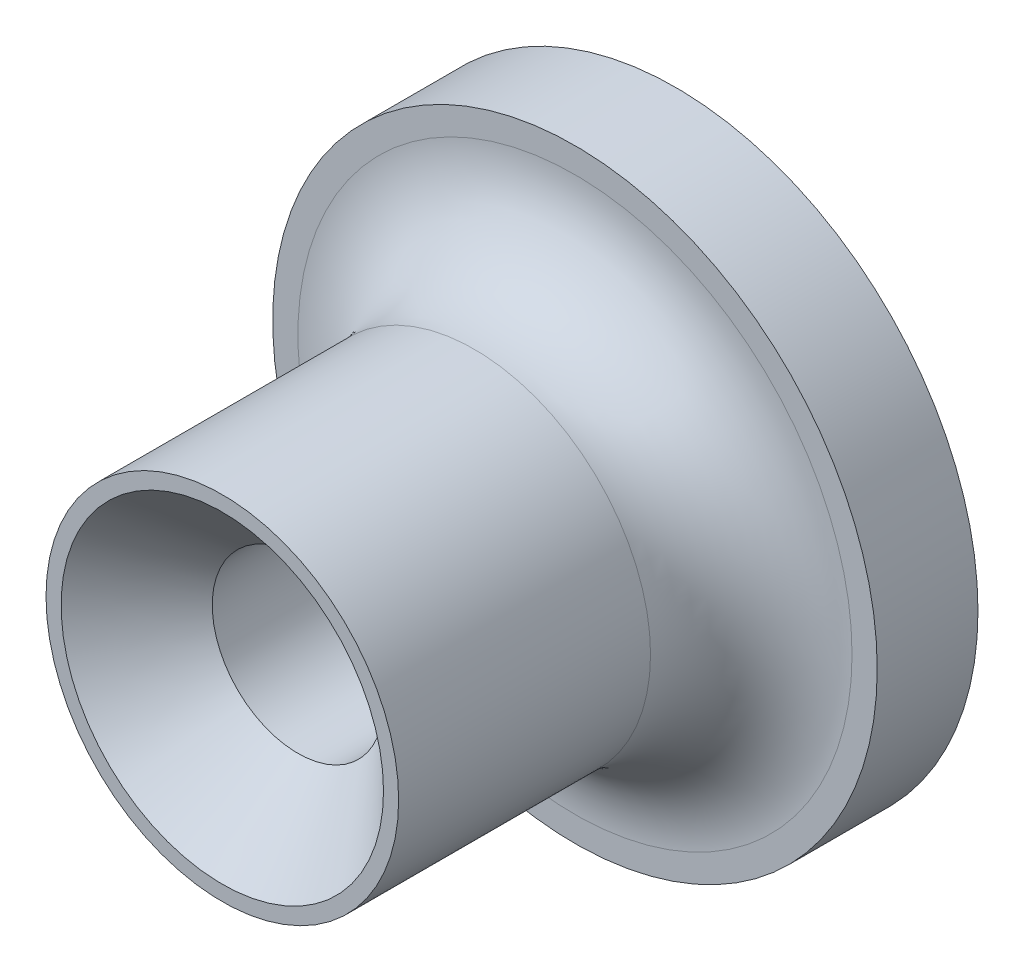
ISO-10303-21;
HEADER;
FILE_DESCRIPTION(('STEP AP214'),'2;1');
FILE_NAME('part.step','',(''),(''),'','','');
FILE_SCHEMA(('AUTOMOTIVE_DESIGN { 1 0 10303 214 1 1 1 1 }'));
ENDSEC;
DATA;
#1=APPLICATION_CONTEXT('core data for automotive mechanical design processes');
#2=APPLICATION_PROTOCOL_DEFINITION('international standard','automotive_design',2000,#1);
#3=PRODUCT_CONTEXT('',#1,'mechanical');
#4=PRODUCT('Part','Part','',(#3));
#5=PRODUCT_RELATED_PRODUCT_CATEGORY('part','',(#4));
#6=PRODUCT_DEFINITION_FORMATION('','',#4);
#7=PRODUCT_DEFINITION_CONTEXT('part definition',#1,'design');
#8=PRODUCT_DEFINITION('design','',#6,#7);
#9=PRODUCT_DEFINITION_SHAPE('','',#8);
#10=(LENGTH_UNIT() NAMED_UNIT(*) SI_UNIT(.MILLI.,.METRE.));
#11=(NAMED_UNIT(*) PLANE_ANGLE_UNIT() SI_UNIT($,.RADIAN.));
#12=(NAMED_UNIT(*) SI_UNIT($,.STERADIAN.) SOLID_ANGLE_UNIT());
#13=UNCERTAINTY_MEASURE_WITH_UNIT(LENGTH_MEASURE(1.E-05),#10,'distance_accuracy_value','');
#14=(GEOMETRIC_REPRESENTATION_CONTEXT(3) GLOBAL_UNCERTAINTY_ASSIGNED_CONTEXT((#13)) GLOBAL_UNIT_ASSIGNED_CONTEXT((#10,
#11,#12)) REPRESENTATION_CONTEXT('',''));
#15=CARTESIAN_POINT('',(0.,0.,0.));
#16=DIRECTION('',(0.,0.,1.));
#17=DIRECTION('',(1.,0.,0.));
#18=AXIS2_PLACEMENT_3D('',#15,#16,#17);
#19=CARTESIAN_POINT('',(-12.7949592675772,3.51861379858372,9.));
#20=DIRECTION('',(0.,0.,-1.));
#21=DIRECTION('',(-1.,0.,0.));
#22=AXIS2_PLACEMENT_3D('',#19,#20,#21);
#23=CYLINDRICAL_SURFACE('',#22,1.7);
#24=CARTESIAN_POINT('',(-12.7949592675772,3.51861379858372,7.5));
#25=DIRECTION('',(0.,0.,1.));
#26=DIRECTION('',(1.,0.,0.));
#27=AXIS2_PLACEMENT_3D('',#24,#25,#26);
#28=CIRCLE('',#27,1.7);
#29=CARTESIAN_POINT('',(-11.0949592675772,3.51861379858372,7.5));
#30=VERTEX_POINT('',#29);
#31=EDGE_CURVE('E51',#30,#30,#28,.T.);
#32=ORIENTED_EDGE('',*,*,#31,.T.);
#33=EDGE_LOOP('',(#32));
#34=FACE_BOUND('',#33,.T.);
#35=CARTESIAN_POINT('',(-12.7949592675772,3.51861379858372,0.));
#36=DIRECTION('',(0.,0.,1.));
#37=DIRECTION('',(1.,0.,0.));
#38=AXIS2_PLACEMENT_3D('',#35,#36,#37);
#39=CIRCLE('',#38,1.7);
#40=CARTESIAN_POINT('',(-11.0949592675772,3.51861379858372,0.));
#41=VERTEX_POINT('',#40);
#42=EDGE_CURVE('E46',#41,#41,#39,.T.);
#43=ORIENTED_EDGE('',*,*,#42,.F.);
#44=EDGE_LOOP('',(#43));
#45=FACE_BOUND('',#44,.T.);
#46=ADVANCED_FACE('F31',(#34,#45),#23,.F.);
#47=CARTESIAN_POINT('',(-12.7949592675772,3.51861379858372,9.));
#48=DIRECTION('',(0.,0.,1.));
#49=DIRECTION('',(1.,0.,0.));
#50=AXIS2_PLACEMENT_3D('',#47,#48,#49);
#51=PLANE('',#50);
#52=CARTESIAN_POINT('',(-12.7949592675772,3.51861379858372,9.));
#53=DIRECTION('',(0.,0.,1.));
#54=DIRECTION('',(1.,0.,0.));
#55=AXIS2_PLACEMENT_3D('',#52,#53,#54);
#56=CIRCLE('',#55,3.2);
#57=CARTESIAN_POINT('',(-9.59495926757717,3.51861379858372,9.));
#58=VERTEX_POINT('',#57);
#59=EDGE_CURVE('E54',#58,#58,#56,.T.);
#60=ORIENTED_EDGE('',*,*,#59,.F.);
#61=EDGE_LOOP('',(#60));
#62=FACE_BOUND('',#61,.T.);
#63=CARTESIAN_POINT('',(-12.7949592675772,3.51861379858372,9.));
#64=DIRECTION('',(0.,0.,1.));
#65=DIRECTION('',(1.,0.,0.));
#66=AXIS2_PLACEMENT_3D('',#63,#64,#65);
#67=CIRCLE('',#66,3.5);
#68=CARTESIAN_POINT('',(-9.29495926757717,3.51861379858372,9.));
#69=VERTEX_POINT('',#68);
#70=EDGE_CURVE('E42',#69,#69,#67,.T.);
#71=ORIENTED_EDGE('',*,*,#70,.T.);
#72=EDGE_LOOP('',(#71));
#73=FACE_BOUND('',#72,.T.);
#74=ADVANCED_FACE('F75',(#62,#73),#51,.T.);
#75=CARTESIAN_POINT('',(-12.7949592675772,3.51861379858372,0.));
#76=DIRECTION('',(0.,0.,1.));
#77=DIRECTION('',(1.,0.,0.));
#78=AXIS2_PLACEMENT_3D('',#75,#76,#77);
#79=PLANE('',#78);
#80=ORIENTED_EDGE('',*,*,#42,.T.);
#81=EDGE_LOOP('',(#80));
#82=FACE_BOUND('',#81,.T.);
#83=CARTESIAN_POINT('',(-12.7949592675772,3.51861379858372,0.));
#84=DIRECTION('',(0.,0.,1.));
#85=DIRECTION('',(1.,0.,0.));
#86=AXIS2_PLACEMENT_3D('',#83,#84,#85);
#87=CIRCLE('',#86,6.);
#88=CARTESIAN_POINT('',(-6.79495926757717,3.51861379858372,0.));
#89=VERTEX_POINT('',#88);
#90=EDGE_CURVE('E58',#89,#89,#87,.T.);
#91=ORIENTED_EDGE('',*,*,#90,.F.);
#92=EDGE_LOOP('',(#91));
#93=FACE_BOUND('',#92,.T.);
#94=ADVANCED_FACE('F72',(#82,#93),#79,.F.);
#95=CARTESIAN_POINT('',(-12.7949592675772,3.51861379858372,9.));
#96=DIRECTION('',(0.,0.,-1.));
#97=DIRECTION('',(-1.,0.,0.));
#98=AXIS2_PLACEMENT_3D('',#95,#96,#97);
#99=CYLINDRICAL_SURFACE('',#98,3.5);
#100=CARTESIAN_POINT('',(-12.7949592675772,3.51861379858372,4.));
#101=DIRECTION('',(0.,0.,1.));
#102=DIRECTION('',(1.,0.,0.));
#103=AXIS2_PLACEMENT_3D('',#100,#101,#102);
#104=CIRCLE('',#103,3.5);
#105=CARTESIAN_POINT('',(-9.29495926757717,3.51861379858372,4.));
#106=VERTEX_POINT('',#105);
#107=EDGE_CURVE('E38',#106,#106,#104,.T.);
#108=ORIENTED_EDGE('',*,*,#107,.T.);
#109=EDGE_LOOP('',(#108));
#110=FACE_BOUND('',#109,.T.);
#111=ORIENTED_EDGE('',*,*,#70,.F.);
#112=EDGE_LOOP('',(#111));
#113=FACE_BOUND('',#112,.T.);
#114=ADVANCED_FACE('F74',(#110,#113),#99,.T.);
#115=CARTESIAN_POINT('',(-12.7949592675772,3.51861379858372,9.));
#116=DIRECTION('',(0.,0.,1.));
#117=DIRECTION('',(1.,0.,0.));
#118=AXIS2_PLACEMENT_3D('',#115,#116,#117);
#119=CONICAL_SURFACE('',#118,3.2,0.785398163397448);
#120=ORIENTED_EDGE('',*,*,#31,.F.);
#121=EDGE_LOOP('',(#120));
#122=FACE_BOUND('',#121,.T.);
#123=ORIENTED_EDGE('',*,*,#59,.T.);
#124=EDGE_LOOP('',(#123));
#125=FACE_BOUND('',#124,.T.);
#126=ADVANCED_FACE('F82',(#122,#125),#119,.F.);
#127=CARTESIAN_POINT('',(-12.7949592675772,3.51861379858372,2.));
#128=DIRECTION('',(0.,0.,1.));
#129=DIRECTION('',(1.,0.,0.));
#130=AXIS2_PLACEMENT_3D('',#127,#128,#129);
#131=PLANE('',#130);
#132=CARTESIAN_POINT('',(-12.7949592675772,3.51861379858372,2.));
#133=DIRECTION('',(0.,0.,1.));
#134=DIRECTION('',(1.,0.,0.));
#135=AXIS2_PLACEMENT_3D('',#132,#133,#134);
#136=CIRCLE('',#135,5.5);
#137=CARTESIAN_POINT('',(-7.29495926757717,3.51861379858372,2.));
#138=VERTEX_POINT('',#137);
#139=EDGE_CURVE('E10',#138,#138,#136,.F.);
#140=ORIENTED_EDGE('',*,*,#139,.T.);
#141=EDGE_LOOP('',(#140));
#142=FACE_BOUND('',#141,.T.);
#143=CARTESIAN_POINT('',(-12.7949592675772,3.51861379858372,2.));
#144=DIRECTION('',(0.,0.,1.));
#145=DIRECTION('',(1.,0.,0.));
#146=AXIS2_PLACEMENT_3D('',#143,#144,#145);
#147=CIRCLE('',#146,6.);
#148=CARTESIAN_POINT('',(-6.79495926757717,3.51861379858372,2.));
#149=VERTEX_POINT('',#148);
#150=EDGE_CURVE('E57',#149,#149,#147,.T.);
#151=ORIENTED_EDGE('',*,*,#150,.T.);
#152=EDGE_LOOP('',(#151));
#153=FACE_BOUND('',#152,.T.);
#154=ADVANCED_FACE('F64',(#142,#153),#131,.T.);
#155=CARTESIAN_POINT('',(-12.7949592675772,3.51861379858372,2.));
#156=DIRECTION('',(0.,0.,-1.));
#157=DIRECTION('',(-1.,0.,0.));
#158=AXIS2_PLACEMENT_3D('',#155,#156,#157);
#159=CYLINDRICAL_SURFACE('',#158,6.);
#160=ORIENTED_EDGE('',*,*,#150,.F.);
#161=EDGE_LOOP('',(#160));
#162=FACE_BOUND('',#161,.T.);
#163=ORIENTED_EDGE('',*,*,#90,.T.);
#164=EDGE_LOOP('',(#163));
#165=FACE_BOUND('',#164,.T.);
#166=ADVANCED_FACE('F66',(#162,#165),#159,.T.);
#167=CARTESIAN_POINT('',(-12.7949592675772,3.51861379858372,4.));
#168=DIRECTION('',(0.,0.,1.));
#169=DIRECTION('',(1.,0.,0.));
#170=AXIS2_PLACEMENT_3D('',#167,#168,#169);
#171=TOROIDAL_SURFACE('',#170,5.5,2.);
#172=ORIENTED_EDGE('',*,*,#139,.F.);
#173=EDGE_LOOP('',(#172));
#174=FACE_BOUND('',#173,.T.);
#175=ORIENTED_EDGE('',*,*,#107,.F.);
#176=EDGE_LOOP('',(#175));
#177=FACE_BOUND('',#176,.T.);
#178=ADVANCED_FACE('F33',(#174,#177),#171,.F.);
#179=CLOSED_SHELL('',(#46,#74,#94,#114,#126,#154,#166,#178));
#180=MANIFOLD_SOLID_BREP('B2',#179);
#181=ADVANCED_BREP_SHAPE_REPRESENTATION('',(#18,#180),#14);
#182=SHAPE_DEFINITION_REPRESENTATION(#9,#181);
ENDSEC;
END-ISO-10303-21;
